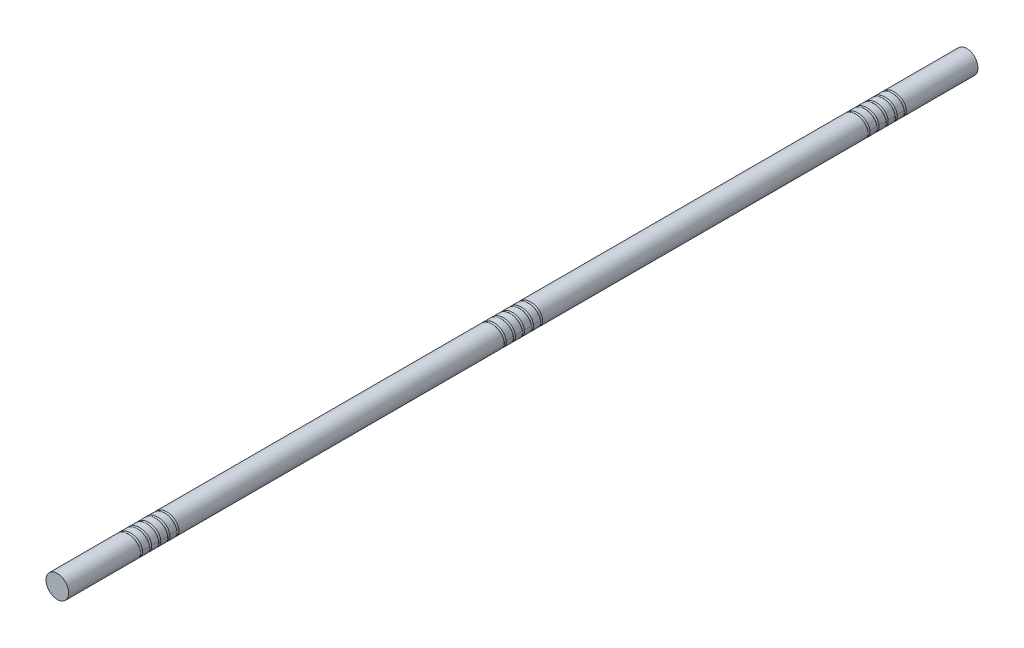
from build123d import *

# Parameters (mm, degrees)
SKETCH1_R              = 25
BOSS_EXTRUDE1_DEPTH    = 2000
CUT_SWEEP1_PITCH       = 20
CUT_SWEEP1_HEIGHT      = 100
CUT_SWEEP1_RADIUS      = 27.116666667
CUT_SWEEP1_START_ANGLE = -180
SKETCH3_R              = 3.175
LPATTERN1_COUNT        = 3
LPATTERN1_PITCH        = 800


with BuildPart() as part:
    # Sketch1 → Boss-Extrude1 (new body)
    with BuildSketch(Plane.XY):
        Circle(SKETCH1_R)
    extrude(amount=BOSS_EXTRUDE1_DEPTH)

    # Cut-Sweep1: sweep along a helix
    with BuildLine() as cut_sweep1_path:
        add(Helix(CUT_SWEEP1_PITCH, CUT_SWEEP1_HEIGHT, CUT_SWEEP1_RADIUS, center=(0, 0, 150), direction=(0, 0, 1), mode=Mode.PRIVATE).rotate(Axis((0, 0, 150), (0, 0, 1)), CUT_SWEEP1_START_ANGLE))
    # Sketch3 → Cut-Sweep1 (sweep, cut)
    with BuildSketch(Plane(origin=(0, 0, 0), x_dir=(1, 0, 0), z_dir=(0, 1, 0))):
        with Locations((-27.116666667, -150)):
            Circle(SKETCH3_R)
    cut_sweep1 = sweep(path=cut_sweep1_path.line, is_frenet=True, mode=Mode.SUBTRACT)

    # LPattern1: Cut-Sweep1 ×3
    with Locations(*[(0, 0, i * LPATTERN1_PITCH) for i in range(1, LPATTERN1_COUNT)]):
        add(cut_sweep1, mode=Mode.SUBTRACT)


solid = part.part
